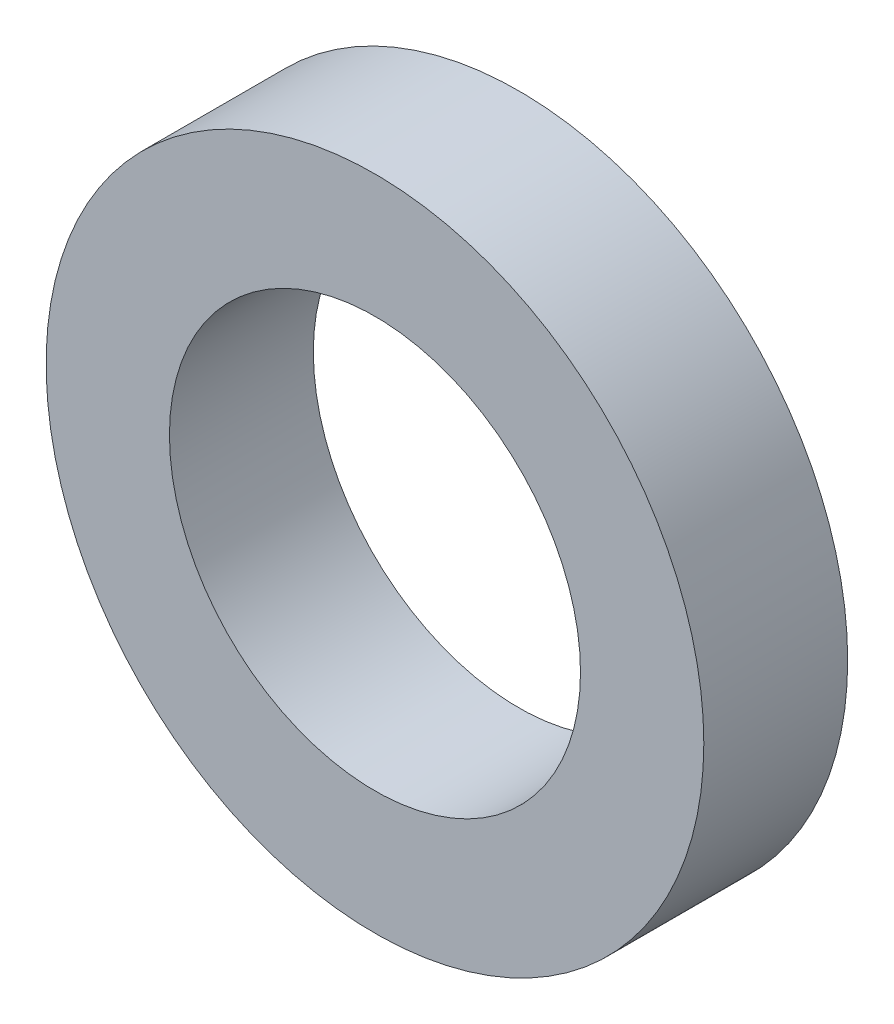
from build123d import *

# Parameters (mm, degrees)
SKETCH_1_R      = 16
SKETCH_1_R_2    = 10
EXTRUDE_1_DEPTH = 7


with BuildPart() as part:
    # Sketch 1 → Extrude 1 (new body)
    with BuildSketch(Plane.XY):
        Circle(SKETCH_1_R)
        Circle(SKETCH_1_R_2, mode=Mode.SUBTRACT)
    extrude(amount=EXTRUDE_1_DEPTH)


solid = part.part
